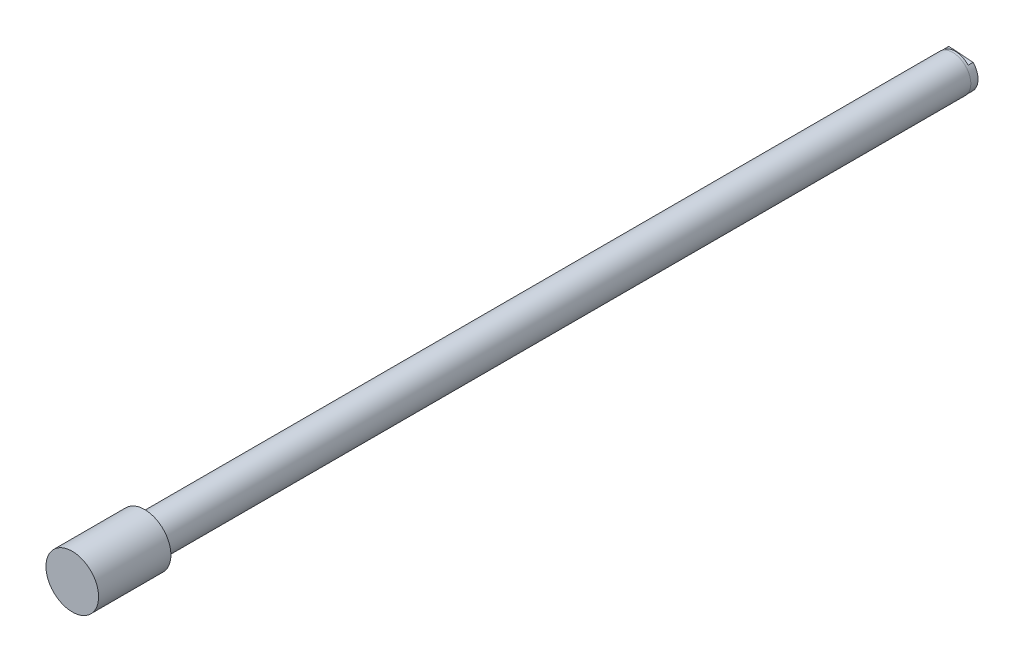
ISO-10303-21;
HEADER;
FILE_DESCRIPTION(('STEP AP214'),'2;1');
FILE_NAME('part.step','',(''),(''),'','','');
FILE_SCHEMA(('AUTOMOTIVE_DESIGN { 1 0 10303 214 1 1 1 1 }'));
ENDSEC;
DATA;
#1=APPLICATION_CONTEXT('core data for automotive mechanical design processes');
#2=APPLICATION_PROTOCOL_DEFINITION('international standard','automotive_design',2000,#1);
#3=PRODUCT_CONTEXT('',#1,'mechanical');
#4=PRODUCT('Part','Part','',(#3));
#5=PRODUCT_RELATED_PRODUCT_CATEGORY('part','',(#4));
#6=PRODUCT_DEFINITION_FORMATION('','',#4);
#7=PRODUCT_DEFINITION_CONTEXT('part definition',#1,'design');
#8=PRODUCT_DEFINITION('design','',#6,#7);
#9=PRODUCT_DEFINITION_SHAPE('','',#8);
#10=(LENGTH_UNIT() NAMED_UNIT(*) SI_UNIT(.MILLI.,.METRE.));
#11=(NAMED_UNIT(*) PLANE_ANGLE_UNIT() SI_UNIT($,.RADIAN.));
#12=(NAMED_UNIT(*) SI_UNIT($,.STERADIAN.) SOLID_ANGLE_UNIT());
#13=UNCERTAINTY_MEASURE_WITH_UNIT(LENGTH_MEASURE(1.E-05),#10,'distance_accuracy_value','');
#14=(GEOMETRIC_REPRESENTATION_CONTEXT(3) GLOBAL_UNCERTAINTY_ASSIGNED_CONTEXT((#13)) GLOBAL_UNIT_ASSIGNED_CONTEXT((#10,
#11,#12)) REPRESENTATION_CONTEXT('',''));
#15=CARTESIAN_POINT('',(0.,0.,0.));
#16=DIRECTION('',(0.,0.,1.));
#17=DIRECTION('',(1.,0.,0.));
#18=AXIS2_PLACEMENT_3D('',#15,#16,#17);
#19=CARTESIAN_POINT('',(0.,0.,-374.65));
#20=DIRECTION('',(0.,0.,-1.));
#21=DIRECTION('',(-1.,0.,0.));
#22=AXIS2_PLACEMENT_3D('',#19,#20,#21);
#23=CYLINDRICAL_SURFACE('',#22,3.4544);
#24=CARTESIAN_POINT('',(0.,0.,-374.65));
#25=DIRECTION('',(0.,0.,-1.));
#26=DIRECTION('',(-1.,0.,0.));
#27=AXIS2_PLACEMENT_3D('',#24,#25,#26);
#28=CIRCLE('',#27,3.4544);
#29=CARTESIAN_POINT('',(-3.45439999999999,0.,-374.65));
#30=VERTEX_POINT('',#29);
#31=EDGE_CURVE('E95',#30,#30,#28,.T.);
#32=ORIENTED_EDGE('',*,*,#31,.F.);
#33=EDGE_LOOP('',(#32));
#34=FACE_BOUND('',#33,.T.);
#35=CARTESIAN_POINT('',(0.,0.,-393.7));
#36=DIRECTION('',(0.,0.,-1.));
#37=DIRECTION('',(-0.997564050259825,0.0697564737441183,0.));
#38=AXIS2_PLACEMENT_3D('',#35,#36,#37);
#39=CIRCLE('',#38,3.4544);
#40=CARTESIAN_POINT('',(-3.44598525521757,0.240966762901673,-393.7));
#41=VERTEX_POINT('',#40);
#42=EDGE_CURVE('E88',#41,#41,#39,.T.);
#43=ORIENTED_EDGE('',*,*,#42,.T.);
#44=EDGE_LOOP('',(#43));
#45=FACE_BOUND('',#44,.T.);
#46=ADVANCED_FACE('F16',(#34,#45),#23,.F.);
#47=CARTESIAN_POINT('',(0.,0.,-374.65));
#48=DIRECTION('',(0.,0.,-1.));
#49=DIRECTION('',(-1.,0.,0.));
#50=AXIS2_PLACEMENT_3D('',#47,#48,#49);
#51=PLANE('',#50);
#52=ORIENTED_EDGE('',*,*,#31,.T.);
#53=EDGE_LOOP('',(#52));
#54=FACE_BOUND('',#53,.T.);
#55=ADVANCED_FACE('F128',(#54),#51,.T.);
#56=CARTESIAN_POINT('',(0.,0.,0.));
#57=DIRECTION('',(0.,0.,1.));
#58=DIRECTION('',(1.,0.,0.));
#59=AXIS2_PLACEMENT_3D('',#56,#57,#58);
#60=PLANE('',#59);
#61=CARTESIAN_POINT('',(0.,0.,0.));
#62=DIRECTION('',(0.,0.,1.));
#63=DIRECTION('',(1.,0.,0.));
#64=AXIS2_PLACEMENT_3D('',#61,#62,#63);
#65=CIRCLE('',#64,8.7376);
#66=CARTESIAN_POINT('',(8.7376,0.,0.));
#67=VERTEX_POINT('',#66);
#68=EDGE_CURVE('E107',#67,#67,#65,.F.);
#69=ORIENTED_EDGE('',*,*,#68,.F.);
#70=EDGE_LOOP('',(#69));
#71=FACE_BOUND('',#70,.T.);
#72=CARTESIAN_POINT('',(0.,0.,0.));
#73=DIRECTION('',(0.,0.,1.));
#74=DIRECTION('',(1.,0.,0.));
#75=AXIS2_PLACEMENT_3D('',#72,#73,#74);
#76=CIRCLE('',#75,12.7);
#77=CARTESIAN_POINT('',(12.7,0.,0.));
#78=VERTEX_POINT('',#77);
#79=EDGE_CURVE('E98',#78,#78,#76,.T.);
#80=ORIENTED_EDGE('',*,*,#79,.F.);
#81=EDGE_LOOP('',(#80));
#82=FACE_BOUND('',#81,.T.);
#83=ADVANCED_FACE('F130',(#71,#82),#60,.F.);
#84=CARTESIAN_POINT('',(0.,0.,34.925));
#85=DIRECTION('',(0.,0.,1.));
#86=DIRECTION('',(1.,0.,0.));
#87=AXIS2_PLACEMENT_3D('',#84,#85,#86);
#88=PLANE('',#87);
#89=CARTESIAN_POINT('',(0.,0.,34.925));
#90=DIRECTION('',(0.,0.,1.));
#91=DIRECTION('',(1.,0.,0.));
#92=AXIS2_PLACEMENT_3D('',#89,#90,#91);
#93=CIRCLE('',#92,12.7);
#94=CARTESIAN_POINT('',(12.7,0.,34.925));
#95=VERTEX_POINT('',#94);
#96=EDGE_CURVE('E103',#95,#95,#93,.T.);
#97=ORIENTED_EDGE('',*,*,#96,.T.);
#98=EDGE_LOOP('',(#97));
#99=FACE_BOUND('',#98,.T.);
#100=ADVANCED_FACE('F137',(#99),#88,.T.);
#101=CARTESIAN_POINT('',(0.,0.,34.925));
#102=DIRECTION('',(0.,0.,-1.));
#103=DIRECTION('',(-1.,0.,0.));
#104=AXIS2_PLACEMENT_3D('',#101,#102,#103);
#105=CYLINDRICAL_SURFACE('',#104,12.7);
#106=ORIENTED_EDGE('',*,*,#96,.F.);
#107=EDGE_LOOP('',(#106));
#108=FACE_BOUND('',#107,.T.);
#109=ORIENTED_EDGE('',*,*,#79,.T.);
#110=EDGE_LOOP('',(#109));
#111=FACE_BOUND('',#110,.T.);
#112=ADVANCED_FACE('F144',(#108,#111),#105,.T.);
#113=CARTESIAN_POINT('',(0.,0.,0.));
#114=DIRECTION('',(0.,0.,-1.));
#115=DIRECTION('',(-1.,0.,0.));
#116=AXIS2_PLACEMENT_3D('',#113,#114,#115);
#117=CYLINDRICAL_SURFACE('',#116,8.7376);
#118=CARTESIAN_POINT('',(0.,0.,-390.1186));
#119=DIRECTION('',(0.,0.,-1.));
#120=DIRECTION('',(-1.,0.,0.));
#121=AXIS2_PLACEMENT_3D('',#118,#119,#120);
#122=CIRCLE('',#121,8.7376);
#123=CARTESIAN_POINT('',(-8.73759999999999,0.,-390.1186));
#124=VERTEX_POINT('',#123);
#125=EDGE_CURVE('E25',#124,#124,#122,.T.);
#126=ORIENTED_EDGE('',*,*,#125,.F.);
#127=EDGE_LOOP('',(#126));
#128=FACE_BOUND('',#127,.T.);
#129=ORIENTED_EDGE('',*,*,#68,.T.);
#130=EDGE_LOOP('',(#129));
#131=FACE_BOUND('',#130,.T.);
#132=ADVANCED_FACE('F149',(#128,#131),#117,.T.);
#133=CARTESIAN_POINT('',(0.,0.,-390.1186));
#134=DIRECTION('',(0.,0.,-1.));
#135=DIRECTION('',(-1.,0.,0.));
#136=AXIS2_PLACEMENT_3D('',#133,#134,#135);
#137=PLANE('',#136);
#138=CARTESIAN_POINT('',(0.,0.,-390.1186));
#139=DIRECTION('',(0.,0.,-1.));
#140=DIRECTION('',(-1.,0.,0.));
#141=AXIS2_PLACEMENT_3D('',#138,#139,#140);
#142=CIRCLE('',#141,8.636);
#143=CARTESIAN_POINT('',(-8.63600000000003,0.,-390.1186));
#144=VERTEX_POINT('',#143);
#145=EDGE_CURVE('E10',#144,#144,#142,.F.);
#146=ORIENTED_EDGE('',*,*,#145,.T.);
#147=EDGE_LOOP('',(#146));
#148=FACE_BOUND('',#147,.T.);
#149=ORIENTED_EDGE('',*,*,#125,.T.);
#150=EDGE_LOOP('',(#149));
#151=FACE_BOUND('',#150,.T.);
#152=ADVANCED_FACE('F151',(#148,#151),#137,.T.);
#153=CARTESIAN_POINT('',(0.,0.,-391.3124));
#154=DIRECTION('',(0.,0.,-1.));
#155=DIRECTION('',(-0.997564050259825,0.0697564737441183,0.));
#156=AXIS2_PLACEMENT_3D('',#153,#154,#155);
#157=PLANE('',#156);
#158=CARTESIAN_POINT('',(0.,0.,-391.3124));
#159=DIRECTION('',(0.,0.,-1.));
#160=DIRECTION('',(-0.997564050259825,0.0697564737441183,0.));
#161=AXIS2_PLACEMENT_3D('',#158,#159,#160);
#162=CIRCLE('',#161,8.636);
#163=CARTESIAN_POINT('',(5.39582175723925,-6.74281866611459,-391.3124));
#164=VERTEX_POINT('',#163);
#165=CARTESIAN_POINT('',(-6.28172897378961,-5.92624477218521,-391.3124));
#166=VERTEX_POINT('',#165);
#167=EDGE_CURVE('E80',#164,#166,#162,.T.);
#168=ORIENTED_EDGE('',*,*,#167,.T.);
#169=DIRECTION('',(0.997564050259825,-0.0697564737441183,0.));
#170=VECTOR('',#169,1.);
#171=CARTESIAN_POINT('',(5.39582175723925,-6.74281866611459,-391.3124));
#172=LINE('',#171,#170);
#173=EDGE_CURVE('E39',#166,#164,#172,.T.);
#174=ORIENTED_EDGE('',*,*,#173,.T.);
#175=EDGE_LOOP('',(#168,#174));
#176=FACE_BOUND('',#175,.T.);
#177=ADVANCED_FACE('F125',(#176),#157,.T.);
#178=CARTESIAN_POINT('',(5.39582175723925,-6.74281866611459,-391.3124));
#179=DIRECTION('',(0.0697564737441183,0.997564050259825,0.));
#180=DIRECTION('',(-0.997564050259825,0.0697564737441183,0.));
#181=AXIS2_PLACEMENT_3D('',#178,#179,#180);
#182=PLANE('',#181);
#183=DIRECTION('',(0.997564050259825,-0.0697564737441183,0.));
#184=VECTOR('',#183,1.);
#185=CARTESIAN_POINT('',(5.39582175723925,-6.74281866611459,-393.7));
#186=LINE('',#185,#184);
#187=CARTESIAN_POINT('',(-6.28172897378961,-5.92624477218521,-393.7));
#188=VERTEX_POINT('',#187);
#189=CARTESIAN_POINT('',(5.39582175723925,-6.74281866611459,-393.7));
#190=VERTEX_POINT('',#189);
#191=EDGE_CURVE('E76',#188,#190,#186,.T.);
#192=ORIENTED_EDGE('',*,*,#191,.T.);
#193=DIRECTION('',(0.,0.,-1.));
#194=VECTOR('',#193,1.);
#195=CARTESIAN_POINT('',(5.39582175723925,-6.74281866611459,-391.3124));
#196=LINE('',#195,#194);
#197=EDGE_CURVE('E86',#164,#190,#196,.T.);
#198=ORIENTED_EDGE('',*,*,#197,.F.);
#199=ORIENTED_EDGE('',*,*,#173,.F.);
#200=DIRECTION('',(0.,0.,-1.));
#201=VECTOR('',#200,1.);
#202=CARTESIAN_POINT('',(-6.28172897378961,-5.92624477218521,-391.3124));
#203=LINE('',#202,#201);
#204=EDGE_CURVE('E83',#166,#188,#203,.T.);
#205=ORIENTED_EDGE('',*,*,#204,.T.);
#206=EDGE_LOOP('',(#192,#198,#199,#205));
#207=FACE_BOUND('',#206,.T.);
#208=ADVANCED_FACE('F115',(#207),#182,.F.);
#209=CARTESIAN_POINT('',(0.,0.,-393.7));
#210=DIRECTION('',(0.,0.,1.));
#211=DIRECTION('',(0.997564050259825,-0.0697564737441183,0.));
#212=AXIS2_PLACEMENT_3D('',#209,#210,#211);
#213=PLANE('',#212);
#214=ORIENTED_EDGE('',*,*,#42,.F.);
#215=EDGE_LOOP('',(#214));
#216=FACE_BOUND('',#215,.T.);
#217=CARTESIAN_POINT('',(0.,0.,-393.7));
#218=DIRECTION('',(0.,0.,-1.));
#219=DIRECTION('',(-0.997564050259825,0.0697564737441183,0.));
#220=AXIS2_PLACEMENT_3D('',#217,#218,#219);
#221=CIRCLE('',#220,8.636);
#222=CARTESIAN_POINT('',(-5.39582175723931,6.74281866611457,-393.7));
#223=VERTEX_POINT('',#222);
#224=EDGE_CURVE('E20',#188,#223,#221,.T.);
#225=ORIENTED_EDGE('',*,*,#224,.T.);
#226=DIRECTION('',(-0.997564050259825,0.0697564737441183,0.));
#227=VECTOR('',#226,1.);
#228=CARTESIAN_POINT('',(6.28172897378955,5.92624477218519,-393.7));
#229=LINE('',#228,#227);
#230=CARTESIAN_POINT('',(6.28172897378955,5.92624477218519,-393.7));
#231=VERTEX_POINT('',#230);
#232=EDGE_CURVE('E62',#231,#223,#229,.T.);
#233=ORIENTED_EDGE('',*,*,#232,.F.);
#234=EDGE_CURVE('E74',#231,#190,#221,.T.);
#235=ORIENTED_EDGE('',*,*,#234,.T.);
#236=ORIENTED_EDGE('',*,*,#191,.F.);
#237=EDGE_LOOP('',(#225,#233,#235,#236));
#238=FACE_BOUND('',#237,.T.);
#239=ADVANCED_FACE('F18',(#216,#238),#213,.F.);
#240=CARTESIAN_POINT('',(6.28172897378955,5.92624477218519,-391.3124));
#241=DIRECTION('',(-0.0697564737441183,-0.997564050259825,0.));
#242=DIRECTION('',(0.997564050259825,-0.0697564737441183,0.));
#243=AXIS2_PLACEMENT_3D('',#240,#241,#242);
#244=PLANE('',#243);
#245=ORIENTED_EDGE('',*,*,#232,.T.);
#246=DIRECTION('',(0.,0.,-1.));
#247=VECTOR('',#246,1.);
#248=CARTESIAN_POINT('',(-5.39582175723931,6.74281866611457,-391.3124));
#249=LINE('',#248,#247);
#250=CARTESIAN_POINT('',(-5.39582175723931,6.74281866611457,-391.3124));
#251=VERTEX_POINT('',#250);
#252=EDGE_CURVE('E68',#251,#223,#249,.T.);
#253=ORIENTED_EDGE('',*,*,#252,.F.);
#254=DIRECTION('',(-0.997564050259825,0.0697564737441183,0.));
#255=VECTOR('',#254,1.);
#256=CARTESIAN_POINT('',(6.28172897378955,5.92624477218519,-391.3124));
#257=LINE('',#256,#255);
#258=CARTESIAN_POINT('',(6.28172897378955,5.92624477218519,-391.3124));
#259=VERTEX_POINT('',#258);
#260=EDGE_CURVE('E32',#259,#251,#257,.T.);
#261=ORIENTED_EDGE('',*,*,#260,.F.);
#262=DIRECTION('',(0.,0.,-1.));
#263=VECTOR('',#262,1.);
#264=CARTESIAN_POINT('',(6.28172897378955,5.92624477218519,-391.3124));
#265=LINE('',#264,#263);
#266=EDGE_CURVE('E66',#259,#231,#265,.T.);
#267=ORIENTED_EDGE('',*,*,#266,.T.);
#268=EDGE_LOOP('',(#245,#253,#261,#267));
#269=FACE_BOUND('',#268,.T.);
#270=ADVANCED_FACE('F65',(#269),#244,.F.);
#271=CARTESIAN_POINT('',(0.,0.,-391.3124));
#272=DIRECTION('',(0.,0.,-1.));
#273=DIRECTION('',(-0.997564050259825,0.0697564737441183,0.));
#274=AXIS2_PLACEMENT_3D('',#271,#272,#273);
#275=PLANE('',#274);
#276=CARTESIAN_POINT('',(0.,0.,-391.3124));
#277=DIRECTION('',(0.,0.,-1.));
#278=DIRECTION('',(-0.997564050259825,0.0697564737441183,0.));
#279=AXIS2_PLACEMENT_3D('',#276,#277,#278);
#280=CIRCLE('',#279,8.636);
#281=EDGE_CURVE('E57',#251,#259,#280,.T.);
#282=ORIENTED_EDGE('',*,*,#281,.T.);
#283=ORIENTED_EDGE('',*,*,#260,.T.);
#284=EDGE_LOOP('',(#282,#283));
#285=FACE_BOUND('',#284,.T.);
#286=ADVANCED_FACE('F58',(#285),#275,.T.);
#287=CARTESIAN_POINT('',(0.,0.,-394.694542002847));
#288=DIRECTION('',(0.,0.,-1.));
#289=DIRECTION('',(-0.997564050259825,0.0697564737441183,0.));
#290=AXIS2_PLACEMENT_3D('',#287,#288,#289);
#291=CYLINDRICAL_SURFACE('',#290,8.636);
#292=ORIENTED_EDGE('',*,*,#281,.F.);
#293=ORIENTED_EDGE('',*,*,#252,.T.);
#294=ORIENTED_EDGE('',*,*,#224,.F.);
#295=ORIENTED_EDGE('',*,*,#204,.F.);
#296=ORIENTED_EDGE('',*,*,#167,.F.);
#297=ORIENTED_EDGE('',*,*,#197,.T.);
#298=ORIENTED_EDGE('',*,*,#234,.F.);
#299=ORIENTED_EDGE('',*,*,#266,.F.);
#300=EDGE_LOOP('',(#292,#293,#294,#295,#296,#297,#298,#299));
#301=FACE_BOUND('',#300,.T.);
#302=ORIENTED_EDGE('',*,*,#145,.F.);
#303=EDGE_LOOP('',(#302));
#304=FACE_BOUND('',#303,.T.);
#305=ADVANCED_FACE('F71',(#301,#304),#291,.T.);
#306=CLOSED_SHELL('',(#46,#55,#83,#100,#112,#132,#152,#177,#208,#239,#270,#286,#305));
#307=MANIFOLD_SOLID_BREP('B1',#306);
#308=ADVANCED_BREP_SHAPE_REPRESENTATION('',(#18,#307),#14);
#309=SHAPE_DEFINITION_REPRESENTATION(#9,#308);
ENDSEC;
END-ISO-10303-21;
